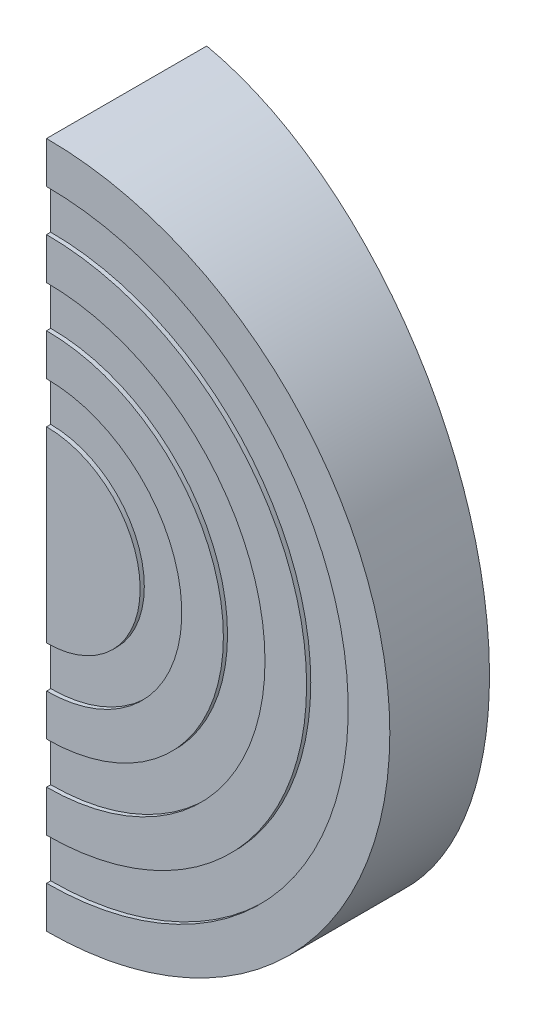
ISO-10303-21;
HEADER;
FILE_DESCRIPTION(('STEP AP214'),'2;1');
FILE_NAME('part.step','',(''),(''),'','','');
FILE_SCHEMA(('AUTOMOTIVE_DESIGN { 1 0 10303 214 1 1 1 1 }'));
ENDSEC;
DATA;
#1=APPLICATION_CONTEXT('core data for automotive mechanical design processes');
#2=APPLICATION_PROTOCOL_DEFINITION('international standard','automotive_design',2000,#1);
#3=PRODUCT_CONTEXT('',#1,'mechanical');
#4=PRODUCT('Part','Part','',(#3));
#5=PRODUCT_RELATED_PRODUCT_CATEGORY('part','',(#4));
#6=PRODUCT_DEFINITION_FORMATION('','',#4);
#7=PRODUCT_DEFINITION_CONTEXT('part definition',#1,'design');
#8=PRODUCT_DEFINITION('design','',#6,#7);
#9=PRODUCT_DEFINITION_SHAPE('','',#8);
#10=(LENGTH_UNIT() NAMED_UNIT(*) SI_UNIT(.MILLI.,.METRE.));
#11=(NAMED_UNIT(*) PLANE_ANGLE_UNIT() SI_UNIT($,.RADIAN.));
#12=(NAMED_UNIT(*) SI_UNIT($,.STERADIAN.) SOLID_ANGLE_UNIT());
#13=UNCERTAINTY_MEASURE_WITH_UNIT(LENGTH_MEASURE(1.E-05),#10,'distance_accuracy_value','');
#14=(GEOMETRIC_REPRESENTATION_CONTEXT(3) GLOBAL_UNCERTAINTY_ASSIGNED_CONTEXT((#13)) GLOBAL_UNIT_ASSIGNED_CONTEXT((#10,
#11,#12)) REPRESENTATION_CONTEXT('',''));
#15=CARTESIAN_POINT('',(0.,0.,0.));
#16=DIRECTION('',(0.,0.,1.));
#17=DIRECTION('',(1.,0.,0.));
#18=AXIS2_PLACEMENT_3D('',#15,#16,#17);
#19=CARTESIAN_POINT('',(5.59106006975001,0.,1.29756118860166));
#20=DIRECTION('',(-0.173648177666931,0.,0.984807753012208));
#21=DIRECTION('',(0.984807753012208,0.,0.173648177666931));
#22=AXIS2_PLACEMENT_3D('',#19,#20,#21);
#23=PLANE('',#22);
#24=CARTESIAN_POINT('',(1.27502279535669,14.3661645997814,0.536527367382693));
#25=CARTESIAN_POINT('',(1.48020566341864,14.3381441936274,0.57270664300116));
#26=CARTESIAN_POINT('',(1.68478495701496,14.3057523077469,0.60877949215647));
#27=CARTESIAN_POINT('',(2.0924217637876,14.2322651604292,0.68065685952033));
#28=CARTESIAN_POINT('',(2.29547927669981,14.1911698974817,0.716461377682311));
#29=CARTESIAN_POINT('',(2.90181089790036,14.0549078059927,0.823374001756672));
#30=CARTESIAN_POINT('',(3.30233184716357,13.9467526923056,0.893996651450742));
#31=CARTESIAN_POINT('',(4.09289086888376,13.6965843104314,1.0333935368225));
#32=CARTESIAN_POINT('',(4.482929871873,13.5545740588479,1.10216793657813));
#33=CARTESIAN_POINT('',(5.24978501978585,13.2375567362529,1.23738518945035));
#34=CARTESIAN_POINT('',(5.62660150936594,13.0625505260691,1.30382810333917));
#35=CARTESIAN_POINT('',(6.3641335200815,12.6808131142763,1.43387489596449));
#36=CARTESIAN_POINT('',(6.72485506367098,12.4740939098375,1.49747983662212));
#37=CARTESIAN_POINT('',(7.42765723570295,12.0302025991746,1.62140282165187));
#38=CARTESIAN_POINT('',(7.76973759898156,11.7930300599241,1.68172081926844));
#39=CARTESIAN_POINT('',(8.43257498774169,11.2899812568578,1.7985969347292));
#40=CARTESIAN_POINT('',(8.75334021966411,11.0241161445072,1.85515649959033));
#41=CARTESIAN_POINT('',(9.37120561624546,10.4654024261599,1.96410283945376));
#42=CARTESIAN_POINT('',(9.66830618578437,10.1725542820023,2.01648968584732));
#43=CARTESIAN_POINT('',(10.2327229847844,9.5660768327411,2.11601159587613));
#44=CARTESIAN_POINT('',(10.5003869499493,9.25278117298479,2.16320797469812));
#45=CARTESIAN_POINT('',(11.0083795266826,8.6041116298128,2.25278077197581));
#46=CARTESIAN_POINT('',(11.2487082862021,8.26873786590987,2.2951572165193));
#47=CARTESIAN_POINT('',(11.7001826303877,7.57825996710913,2.37476432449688));
#48=CARTESIAN_POINT('',(11.911325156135,7.22315376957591,2.41199444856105));
#49=CARTESIAN_POINT('',(12.3027103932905,6.49579590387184,2.48100622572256));
#50=CARTESIAN_POINT('',(12.4829534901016,6.12354444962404,2.51278794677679));
#51=CARTESIAN_POINT('',(12.8082692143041,5.37111156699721,2.57014988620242));
#52=CARTESIAN_POINT('',(12.9538908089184,4.99117477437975,2.5958269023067));
#53=CARTESIAN_POINT('',(13.2127389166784,4.22008759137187,2.64146880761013));
#54=CARTESIAN_POINT('',(13.3259657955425,3.82893732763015,2.66143376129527));
#55=CARTESIAN_POINT('',(13.51907739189,3.03829434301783,2.69548454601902));
#56=CARTESIAN_POINT('',(13.5989664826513,2.63880272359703,2.70957114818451));
#57=CARTESIAN_POINT('',(13.7248235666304,1.83434685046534,2.7317631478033));
#58=CARTESIAN_POINT('',(13.7707917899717,1.42938263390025,2.73986858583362));
#59=CARTESIAN_POINT('',(13.8280105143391,0.622209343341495,2.7499577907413));
#60=CARTESIAN_POINT('',(13.839702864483,0.220032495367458,2.75201946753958));
#61=CARTESIAN_POINT('',(13.8295931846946,-0.58403829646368,2.75023685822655));
#62=CARTESIAN_POINT('',(13.8077786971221,-0.985932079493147,2.7463903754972));
#63=CARTESIAN_POINT('',(13.730755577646,-1.78622985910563,2.73280912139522));
#64=CARTESIAN_POINT('',(13.6755613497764,-2.18463528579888,2.72307688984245));
#65=CARTESIAN_POINT('',(13.5322605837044,-2.97548135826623,2.69780909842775));
#66=CARTESIAN_POINT('',(13.4441391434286,-3.36791921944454,2.68227091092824));
#67=CARTESIAN_POINT('',(13.2359121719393,-4.14272185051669,2.64555487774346));
#68=CARTESIAN_POINT('',(13.1158999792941,-4.52511249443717,2.62439349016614));
#69=CARTESIAN_POINT('',(12.8448256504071,-5.27817551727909,2.57659577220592));
#70=CARTESIAN_POINT('',(12.6937774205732,-5.64885305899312,2.54996189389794));
#71=CARTESIAN_POINT('',(12.3616292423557,-6.37623471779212,2.49139520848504));
#72=CARTESIAN_POINT('',(12.1805171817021,-6.73293313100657,2.45946026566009));
#73=CARTESIAN_POINT('',(11.7897643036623,-7.42966260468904,2.3905599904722));
#74=CARTESIAN_POINT('',(11.5801336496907,-7.76969954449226,2.35359645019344));
#75=CARTESIAN_POINT('',(11.1319651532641,-8.43369232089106,2.27457225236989));
#76=CARTESIAN_POINT('',(10.8932016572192,-8.75749111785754,2.23247180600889));
#77=CARTESIAN_POINT('',(10.3899626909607,-9.38378325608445,2.14373719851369));
#78=CARTESIAN_POINT('',(10.1254870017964,-9.68627641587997,2.09710299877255));
#79=CARTESIAN_POINT('',(9.57270244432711,-10.2680183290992,1.99963216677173));
#80=CARTESIAN_POINT('',(9.28438891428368,-10.5472625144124,1.94879471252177));
#81=CARTESIAN_POINT('',(8.68604452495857,-11.0806138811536,1.84329045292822));
#82=CARTESIAN_POINT('',(8.37601387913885,-11.3347213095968,1.78862368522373));
#83=CARTESIAN_POINT('',(7.73138127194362,-11.820022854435,1.67495756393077));
#84=CARTESIAN_POINT('',(7.39646825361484,-12.0507910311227,1.6159033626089));
#85=CARTESIAN_POINT('',(6.70886433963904,-12.4832403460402,1.49466024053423));
#86=CARTESIAN_POINT('',(6.35617179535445,-12.6849187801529,1.43247102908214));
#87=CARTESIAN_POINT('',(5.63577762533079,-13.0578162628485,1.30544610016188));
#88=CARTESIAN_POINT('',(5.26808554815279,-13.2290543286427,1.24061206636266));
#89=CARTESIAN_POINT('',(4.52016975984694,-13.5400495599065,1.1087343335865));
#90=CARTESIAN_POINT('',(4.13995009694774,-13.6798167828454,1.04169134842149));
#91=CARTESIAN_POINT('',(3.350002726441,-13.9333705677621,0.902402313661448));
#92=CARTESIAN_POINT('',(2.93975337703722,-14.045493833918,0.830064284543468));
#93=CARTESIAN_POINT('',(2.3188971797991,-14.1863073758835,0.72059058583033));
#94=CARTESIAN_POINT('',(2.11120834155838,-14.2286591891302,0.683969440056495));
#95=CARTESIAN_POINT('',(1.69423169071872,-14.3042537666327,0.610445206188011));
#96=CARTESIAN_POINT('',(1.48494389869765,-14.3374966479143,0.573542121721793));
#97=CARTESIAN_POINT('',(1.27502279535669,-14.3661645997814,0.536527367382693));
#98=B_SPLINE_CURVE_WITH_KNOTS('',3,(#24,#25,#26,#27,#28,#29,#30,#31,#32,#33,#34,#35,#36,#37,#38,
#39,#40,#41,#42,#43,#44,#45,#46,#47,#48,#49,#50,#51,#52,#53,#54,#55,#56,#57,#58,#59,#60,#61,#62,
#63,#64,#65,#66,#67,#68,#69,#70,#71,#72,#73,#74,#75,#76,#77,#78,#79,#80,#81,#82,#83,#84,#85,#86,
#87,#88,#89,#90,#91,#92,#93,#94,#95,#96,#97),.UNSPECIFIED.,.F.,.F.,(4,2,2,2,2,2,2,2,2,2,2,2,2,2,
2,2,2,2,2,2,2,2,2,2,2,2,2,2,2,2,2,2,2,2,2,2,4),(0.,0.630575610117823,1.26115132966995,
2.52203389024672,3.78280414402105,5.04354151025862,6.30380310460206,7.56408262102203,
8.82387407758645,10.0836439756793,11.3264189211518,12.5691871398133,13.8120855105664,
15.0549683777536,16.2765869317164,17.4981916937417,18.719636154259,19.9410723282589,
21.1466922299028,22.3527604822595,23.5583086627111,24.7644031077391,25.9670056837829,
27.1690705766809,28.371620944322,29.5737438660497,30.7858522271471,31.9979709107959,
33.210327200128,34.4226715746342,35.6541895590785,36.8858219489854,38.1166821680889,
39.3471484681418,40.6395946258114,41.2847337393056,41.9298645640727),.UNSPECIFIED.);
#99=CARTESIAN_POINT('',(1.27502279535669,14.3661645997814,0.536527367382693));
#100=VERTEX_POINT('',#99);
#101=CARTESIAN_POINT('',(1.27502279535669,-14.3661645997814,0.536527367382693));
#102=VERTEX_POINT('',#101);
#103=EDGE_CURVE('E22',#100,#102,#98,.T.);
#104=ORIENTED_EDGE('',*,*,#103,.T.);
#105=DIRECTION('',(0.,1.,0.));
#106=VECTOR('',#105,1.);
#107=CARTESIAN_POINT('',(1.27502279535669,-14.3661645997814,0.536527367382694));
#108=LINE('',#107,#106);
#109=EDGE_CURVE('E136',#102,#100,#108,.T.);
#110=ORIENTED_EDGE('',*,*,#109,.T.);
#111=EDGE_LOOP('',(#104,#110));
#112=FACE_BOUND('',#111,.T.);
#113=ADVANCED_FACE('F15',(#112),#23,.F.);
#114=CARTESIAN_POINT('',(0.,0.,3.75));
#115=DIRECTION('',(0.,0.,1.));
#116=DIRECTION('',(1.,0.,0.));
#117=AXIS2_PLACEMENT_3D('',#114,#115,#116);
#118=CYLINDRICAL_SURFACE('',#117,4.5);
#119=CARTESIAN_POINT('',(0.,0.,3.75));
#120=DIRECTION('',(0.,0.,1.));
#121=DIRECTION('',(1.,0.,0.));
#122=AXIS2_PLACEMENT_3D('',#119,#120,#121);
#123=CIRCLE('',#122,4.5);
#124=CARTESIAN_POINT('',(0.,4.5,3.75));
#125=VERTEX_POINT('',#124);
#126=CARTESIAN_POINT('',(0.,-4.5,3.75));
#127=VERTEX_POINT('',#126);
#128=EDGE_CURVE('E312',#125,#127,#123,.F.);
#129=ORIENTED_EDGE('',*,*,#128,.F.);
#130=DIRECTION('',(0.,0.,1.));
#131=VECTOR('',#130,1.);
#132=CARTESIAN_POINT('',(0.,4.5,3.75));
#133=LINE('',#132,#131);
#134=CARTESIAN_POINT('',(0.,4.5,3.95));
#135=VERTEX_POINT('',#134);
#136=EDGE_CURVE('E155',#125,#135,#133,.T.);
#137=ORIENTED_EDGE('',*,*,#136,.T.);
#138=CARTESIAN_POINT('',(0.,0.,3.95));
#139=DIRECTION('',(0.,0.,1.));
#140=DIRECTION('',(1.,0.,0.));
#141=AXIS2_PLACEMENT_3D('',#138,#139,#140);
#142=CIRCLE('',#141,4.5);
#143=CARTESIAN_POINT('',(0.,-4.5,3.95));
#144=VERTEX_POINT('',#143);
#145=EDGE_CURVE('E289',#144,#135,#142,.T.);
#146=ORIENTED_EDGE('',*,*,#145,.F.);
#147=DIRECTION('',(0.,0.,1.));
#148=VECTOR('',#147,1.);
#149=CARTESIAN_POINT('',(0.,-4.5,3.75));
#150=LINE('',#149,#148);
#151=EDGE_CURVE('E306',#144,#127,#150,.F.);
#152=ORIENTED_EDGE('',*,*,#151,.T.);
#153=EDGE_LOOP('',(#129,#137,#146,#152));
#154=FACE_BOUND('',#153,.T.);
#155=ADVANCED_FACE('F227',(#154),#118,.T.);
#156=CARTESIAN_POINT('',(0.,0.,3.75));
#157=DIRECTION('',(0.,0.,1.));
#158=DIRECTION('',(1.,0.,0.));
#159=AXIS2_PLACEMENT_3D('',#156,#157,#158);
#160=CYLINDRICAL_SURFACE('',#159,6.5);
#161=DIRECTION('',(0.,0.,1.));
#162=VECTOR('',#161,1.);
#163=CARTESIAN_POINT('',(0.,6.5,3.75));
#164=LINE('',#163,#162);
#165=CARTESIAN_POINT('',(0.,6.5,3.75));
#166=VERTEX_POINT('',#165);
#167=CARTESIAN_POINT('',(0.,6.5,3.95));
#168=VERTEX_POINT('',#167);
#169=EDGE_CURVE('E302',#166,#168,#164,.T.);
#170=ORIENTED_EDGE('',*,*,#169,.F.);
#171=CARTESIAN_POINT('',(0.,0.,3.75));
#172=DIRECTION('',(0.,0.,1.));
#173=DIRECTION('',(1.,0.,0.));
#174=AXIS2_PLACEMENT_3D('',#171,#172,#173);
#175=CIRCLE('',#174,6.5);
#176=CARTESIAN_POINT('',(0.,-6.5,3.75));
#177=VERTEX_POINT('',#176);
#178=EDGE_CURVE('E314',#177,#166,#175,.T.);
#179=ORIENTED_EDGE('',*,*,#178,.F.);
#180=DIRECTION('',(0.,0.,1.));
#181=VECTOR('',#180,1.);
#182=CARTESIAN_POINT('',(0.,-6.5,3.75));
#183=LINE('',#182,#181);
#184=CARTESIAN_POINT('',(0.,-6.5,3.95));
#185=VERTEX_POINT('',#184);
#186=EDGE_CURVE('E305',#185,#177,#183,.F.);
#187=ORIENTED_EDGE('',*,*,#186,.F.);
#188=CARTESIAN_POINT('',(0.,0.,3.95));
#189=DIRECTION('',(0.,0.,1.));
#190=DIRECTION('',(1.,0.,0.));
#191=AXIS2_PLACEMENT_3D('',#188,#189,#190);
#192=CIRCLE('',#191,6.5);
#193=EDGE_CURVE('E321',#168,#185,#192,.F.);
#194=ORIENTED_EDGE('',*,*,#193,.F.);
#195=EDGE_LOOP('',(#170,#179,#187,#194));
#196=FACE_BOUND('',#195,.T.);
#197=ADVANCED_FACE('F223',(#196),#160,.F.);
#198=CARTESIAN_POINT('',(0.,0.,3.75));
#199=DIRECTION('',(0.,0.,1.));
#200=DIRECTION('',(1.,0.,0.));
#201=AXIS2_PLACEMENT_3D('',#198,#199,#200);
#202=CYLINDRICAL_SURFACE('',#201,8.5);
#203=CARTESIAN_POINT('',(0.,0.,3.75));
#204=DIRECTION('',(0.,0.,1.));
#205=DIRECTION('',(1.,0.,0.));
#206=AXIS2_PLACEMENT_3D('',#203,#204,#205);
#207=CIRCLE('',#206,8.5);
#208=CARTESIAN_POINT('',(0.,8.5,3.75));
#209=VERTEX_POINT('',#208);
#210=CARTESIAN_POINT('',(0.,-8.5,3.75));
#211=VERTEX_POINT('',#210);
#212=EDGE_CURVE('E330',#209,#211,#207,.F.);
#213=ORIENTED_EDGE('',*,*,#212,.F.);
#214=DIRECTION('',(0.,0.,1.));
#215=VECTOR('',#214,1.);
#216=CARTESIAN_POINT('',(0.,8.5,3.75));
#217=LINE('',#216,#215);
#218=CARTESIAN_POINT('',(0.,8.5,3.95));
#219=VERTEX_POINT('',#218);
#220=EDGE_CURVE('E299',#209,#219,#217,.T.);
#221=ORIENTED_EDGE('',*,*,#220,.T.);
#222=CARTESIAN_POINT('',(0.,0.,3.95));
#223=DIRECTION('',(0.,0.,1.));
#224=DIRECTION('',(1.,0.,0.));
#225=AXIS2_PLACEMENT_3D('',#222,#223,#224);
#226=CIRCLE('',#225,8.5);
#227=CARTESIAN_POINT('',(0.,-8.5,3.95));
#228=VERTEX_POINT('',#227);
#229=EDGE_CURVE('E318',#228,#219,#226,.T.);
#230=ORIENTED_EDGE('',*,*,#229,.F.);
#231=DIRECTION('',(0.,0.,1.));
#232=VECTOR('',#231,1.);
#233=CARTESIAN_POINT('',(0.,-8.5,3.75));
#234=LINE('',#233,#232);
#235=EDGE_CURVE('E300',#228,#211,#234,.F.);
#236=ORIENTED_EDGE('',*,*,#235,.T.);
#237=EDGE_LOOP('',(#213,#221,#230,#236));
#238=FACE_BOUND('',#237,.T.);
#239=ADVANCED_FACE('F219',(#238),#202,.T.);
#240=CARTESIAN_POINT('',(0.,0.,3.75));
#241=DIRECTION('',(0.,0.,1.));
#242=DIRECTION('',(1.,0.,0.));
#243=AXIS2_PLACEMENT_3D('',#240,#241,#242);
#244=CYLINDRICAL_SURFACE('',#243,10.5);
#245=DIRECTION('',(0.,0.,1.));
#246=VECTOR('',#245,1.);
#247=CARTESIAN_POINT('',(0.,10.5,3.75));
#248=LINE('',#247,#246);
#249=CARTESIAN_POINT('',(0.,10.5,3.75));
#250=VERTEX_POINT('',#249);
#251=CARTESIAN_POINT('',(0.,10.5,3.95));
#252=VERTEX_POINT('',#251);
#253=EDGE_CURVE('E294',#250,#252,#248,.T.);
#254=ORIENTED_EDGE('',*,*,#253,.F.);
#255=CARTESIAN_POINT('',(0.,0.,3.75));
#256=DIRECTION('',(0.,0.,1.));
#257=DIRECTION('',(1.,0.,0.));
#258=AXIS2_PLACEMENT_3D('',#255,#256,#257);
#259=CIRCLE('',#258,10.5);
#260=CARTESIAN_POINT('',(0.,-10.5,3.75));
#261=VERTEX_POINT('',#260);
#262=EDGE_CURVE('E327',#261,#250,#259,.T.);
#263=ORIENTED_EDGE('',*,*,#262,.F.);
#264=DIRECTION('',(0.,0.,1.));
#265=VECTOR('',#264,1.);
#266=CARTESIAN_POINT('',(0.,-10.5,3.75));
#267=LINE('',#266,#265);
#268=CARTESIAN_POINT('',(0.,-10.5,3.95));
#269=VERTEX_POINT('',#268);
#270=EDGE_CURVE('E297',#269,#261,#267,.F.);
#271=ORIENTED_EDGE('',*,*,#270,.F.);
#272=CARTESIAN_POINT('',(0.,0.,3.95));
#273=DIRECTION('',(0.,0.,1.));
#274=DIRECTION('',(1.,0.,0.));
#275=AXIS2_PLACEMENT_3D('',#272,#273,#274);
#276=CIRCLE('',#275,10.5);
#277=EDGE_CURVE('E336',#252,#269,#276,.F.);
#278=ORIENTED_EDGE('',*,*,#277,.F.);
#279=EDGE_LOOP('',(#254,#263,#271,#278));
#280=FACE_BOUND('',#279,.T.);
#281=ADVANCED_FACE('F215',(#280),#244,.F.);
#282=CARTESIAN_POINT('',(0.,0.,3.75));
#283=DIRECTION('',(0.,0.,1.));
#284=DIRECTION('',(1.,0.,0.));
#285=AXIS2_PLACEMENT_3D('',#282,#283,#284);
#286=CYLINDRICAL_SURFACE('',#285,12.5);
#287=CARTESIAN_POINT('',(0.,0.,3.75));
#288=DIRECTION('',(0.,0.,1.));
#289=DIRECTION('',(1.,0.,0.));
#290=AXIS2_PLACEMENT_3D('',#287,#288,#289);
#291=CIRCLE('',#290,12.5);
#292=CARTESIAN_POINT('',(0.,12.5,3.75));
#293=VERTEX_POINT('',#292);
#294=CARTESIAN_POINT('',(0.,-12.5,3.75));
#295=VERTEX_POINT('',#294);
#296=EDGE_CURVE('E172',#293,#295,#291,.F.);
#297=ORIENTED_EDGE('',*,*,#296,.F.);
#298=DIRECTION('',(0.,0.,1.));
#299=VECTOR('',#298,1.);
#300=CARTESIAN_POINT('',(0.,12.5,3.75));
#301=LINE('',#300,#299);
#302=CARTESIAN_POINT('',(0.,12.5,3.95));
#303=VERTEX_POINT('',#302);
#304=EDGE_CURVE('E139',#293,#303,#301,.T.);
#305=ORIENTED_EDGE('',*,*,#304,.T.);
#306=CARTESIAN_POINT('',(0.,0.,3.95));
#307=DIRECTION('',(0.,0.,1.));
#308=DIRECTION('',(1.,0.,0.));
#309=AXIS2_PLACEMENT_3D('',#306,#307,#308);
#310=CIRCLE('',#309,12.5);
#311=CARTESIAN_POINT('',(0.,-12.5,3.95));
#312=VERTEX_POINT('',#311);
#313=EDGE_CURVE('E333',#312,#303,#310,.T.);
#314=ORIENTED_EDGE('',*,*,#313,.F.);
#315=DIRECTION('',(0.,0.,1.));
#316=VECTOR('',#315,1.);
#317=CARTESIAN_POINT('',(0.,-12.5,3.75));
#318=LINE('',#317,#316);
#319=EDGE_CURVE('E292',#312,#295,#318,.F.);
#320=ORIENTED_EDGE('',*,*,#319,.T.);
#321=EDGE_LOOP('',(#297,#305,#314,#320));
#322=FACE_BOUND('',#321,.T.);
#323=ADVANCED_FACE('F212',(#322),#286,.T.);
#324=CARTESIAN_POINT('',(1.96961550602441,-14.3661645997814,-3.40270364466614));
#325=CARTESIAN_POINT('',(1.27502279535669,-14.3661645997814,0.536527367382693));
#326=CARTESIAN_POINT('',(2.5446479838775,-14.2876537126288,-3.301309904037));
#327=CARTESIAN_POINT('',(1.85005527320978,-14.2876537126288,0.637921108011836));
#328=CARTESIAN_POINT('',(3.68520447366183,-14.0618070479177,-3.10019902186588));
#329=CARTESIAN_POINT('',(2.9906117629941,-14.0618070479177,0.839031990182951));
#330=CARTESIAN_POINT('',(5.0665251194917,-13.6115458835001,-2.85663492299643));
#331=CARTESIAN_POINT('',(4.37193240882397,-13.6115458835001,1.0825960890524));
#332=CARTESIAN_POINT('',(6.39969436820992,-13.040369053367,-2.62156121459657));
#333=CARTESIAN_POINT('',(5.7051016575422,-13.040369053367,1.31766979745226));
#334=CARTESIAN_POINT('',(7.4219355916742,-12.4892098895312,-2.44131250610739));
#335=CARTESIAN_POINT('',(6.72734288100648,-12.4892098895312,1.49791850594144));
#336=CARTESIAN_POINT('',(8.63068698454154,-11.6900525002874,-2.22817702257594));
#337=CARTESIAN_POINT('',(7.93609427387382,-11.6900525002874,1.71105398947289));
#338=CARTESIAN_POINT('',(9.53725423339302,-10.9660796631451,-2.06832475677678));
#339=CARTESIAN_POINT('',(8.84266152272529,-10.9660796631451,1.87090625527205));
#340=CARTESIAN_POINT('',(10.582881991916,-9.96515740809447,-1.88395237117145));
#341=CARTESIAN_POINT('',(9.88828928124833,-9.96515740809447,2.05527864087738));
#342=CARTESIAN_POINT('',(11.3448669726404,-9.09202815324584,-1.74959386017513));
#343=CARTESIAN_POINT('',(10.6502742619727,-9.09202815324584,2.1896371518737));
#344=CARTESIAN_POINT('',(12.194173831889,-7.92190845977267,-1.59983814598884));
#345=CARTESIAN_POINT('',(11.4995811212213,-7.92190845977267,2.33939286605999));
#346=CARTESIAN_POINT('',(12.7874984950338,-6.92791317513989,-1.49521899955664));
#347=CARTESIAN_POINT('',(12.0929057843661,-6.92791317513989,2.44401201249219));
#348=CARTESIAN_POINT('',(13.4137654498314,-5.62634328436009,-1.3847912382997));
#349=CARTESIAN_POINT('',(12.7191727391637,-5.62634328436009,2.55443977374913));
#350=CARTESIAN_POINT('',(13.8198509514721,-4.54341546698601,-1.31318740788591));
#351=CARTESIAN_POINT('',(13.1252582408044,-4.54341546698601,2.62604360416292));
#352=CARTESIAN_POINT('',(14.2035428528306,-3.15204893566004,-1.24553217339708));
#353=CARTESIAN_POINT('',(13.5089501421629,-3.15204893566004,2.69369883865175));
#354=CARTESIAN_POINT('',(14.4097723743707,-2.0147253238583,-1.20916834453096));
#355=CARTESIAN_POINT('',(13.715179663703,-2.0147253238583,2.73006266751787));
#356=CARTESIAN_POINT('',(14.5389996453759,-0.577813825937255,-1.18638209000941));
#357=CARTESIAN_POINT('',(13.8444069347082,-0.577813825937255,2.75284892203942));
#358=CARTESIAN_POINT('',(14.5389996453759,0.577813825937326,-1.18638209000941));
#359=CARTESIAN_POINT('',(13.8444069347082,0.577813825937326,2.75284892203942));
#360=CARTESIAN_POINT('',(14.4097723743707,2.01472532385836,-1.20916834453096));
#361=CARTESIAN_POINT('',(13.715179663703,2.01472532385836,2.73006266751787));
#362=CARTESIAN_POINT('',(14.2035428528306,3.1520489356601,-1.24553217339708));
#363=CARTESIAN_POINT('',(13.5089501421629,3.1520489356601,2.69369883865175));
#364=CARTESIAN_POINT('',(13.8198509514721,4.54341546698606,-1.31318740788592));
#365=CARTESIAN_POINT('',(13.1252582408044,4.54341546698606,2.62604360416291));
#366=CARTESIAN_POINT('',(13.4137654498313,5.62634328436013,-1.38479123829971));
#367=CARTESIAN_POINT('',(12.7191727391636,5.62634328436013,2.55443977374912));
#368=CARTESIAN_POINT('',(12.7874984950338,6.92791317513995,-1.49521899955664));
#369=CARTESIAN_POINT('',(12.0929057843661,6.92791317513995,2.44401201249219));
#370=CARTESIAN_POINT('',(12.194173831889,7.92190845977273,-1.59983814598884));
#371=CARTESIAN_POINT('',(11.4995811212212,7.92190845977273,2.33939286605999));
#372=CARTESIAN_POINT('',(11.3448669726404,9.09202815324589,-1.74959386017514));
#373=CARTESIAN_POINT('',(10.6502742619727,9.09202815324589,2.1896371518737));
#374=CARTESIAN_POINT('',(10.582881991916,9.96515740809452,-1.88395237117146));
#375=CARTESIAN_POINT('',(9.88828928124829,9.96515740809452,2.05527864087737));
#376=CARTESIAN_POINT('',(9.53725423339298,10.9660796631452,-2.06832475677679));
#377=CARTESIAN_POINT('',(8.84266152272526,10.9660796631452,1.87090625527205));
#378=CARTESIAN_POINT('',(8.6306869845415,11.6900525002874,-2.22817702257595));
#379=CARTESIAN_POINT('',(7.93609427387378,11.6900525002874,1.71105398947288));
#380=CARTESIAN_POINT('',(7.42193559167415,12.4892098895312,-2.4413125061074));
#381=CARTESIAN_POINT('',(6.72734288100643,12.4892098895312,1.49791850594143));
#382=CARTESIAN_POINT('',(6.39969436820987,13.040369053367,-2.62156121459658));
#383=CARTESIAN_POINT('',(5.70510165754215,13.040369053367,1.31766979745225));
#384=CARTESIAN_POINT('',(5.06652511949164,13.6115458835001,-2.85663492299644));
#385=CARTESIAN_POINT('',(4.37193240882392,13.6115458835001,1.08259608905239));
#386=CARTESIAN_POINT('',(3.68520447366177,14.0618070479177,-3.10019902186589));
#387=CARTESIAN_POINT('',(2.99061176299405,14.0618070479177,0.839031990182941));
#388=CARTESIAN_POINT('',(2.54464798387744,14.2876537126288,-3.30130990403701));
#389=CARTESIAN_POINT('',(1.85005527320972,14.2876537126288,0.637921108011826));
#390=CARTESIAN_POINT('',(1.96961550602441,14.3661645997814,-3.40270364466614));
#391=CARTESIAN_POINT('',(1.27502279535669,14.3661645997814,0.536527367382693));
#392=B_SPLINE_SURFACE_WITH_KNOTS('',3,1,((#324,#325),(#326,#327),(#328,#329),(#330,#331),(#332,
#333),(#334,#335),(#336,#337),(#338,#339),(#340,#341),(#342,#343),(#344,#345),(#346,#347),(#348,
#349),(#350,#351),(#352,#353),(#354,#355),(#356,#357),(#358,#359),(#360,#361),(#362,#363),(#364,
#365),(#366,#367),(#368,#369),(#370,#371),(#372,#373),(#374,#375),(#376,#377),(#378,#379),(#380,
#381),(#382,#383),(#384,#385),(#386,#387),(#388,#389),(#390,#391)),.UNSPECIFIED.,.F.,.F.,.F.,(4,
1,1,1,1,1,1,1,1,1,1,1,1,1,1,1,1,1,1,1,1,1,1,1,1,1,1,1,1,1,1,4),(2,2),(1.70649027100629,
1.82608213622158,1.94567400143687,2.00546993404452,2.12506179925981,2.18485773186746,
2.30444959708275,2.36424552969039,2.48383739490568,2.54363332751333,2.66322519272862,
2.72302112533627,2.84261299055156,2.90240892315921,3.0220007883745,3.08179672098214,
3.20138858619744,3.26118451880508,3.38077638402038,3.44057231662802,3.56016418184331,
3.61996011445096,3.73955197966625,3.7993479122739,3.91893977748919,3.97873571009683,
4.09832757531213,4.15812350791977,4.27771537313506,4.33751130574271,4.457103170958,
4.57669503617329),(0.,0.4),.UNSPECIFIED.);
#393=DIRECTION('',(-0.173648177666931,0.,0.984807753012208));
#394=VECTOR('',#393,1.);
#395=CARTESIAN_POINT('',(1.96961550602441,14.3661645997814,-3.40270364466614));
#396=LINE('',#395,#394);
#397=CARTESIAN_POINT('',(1.96961550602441,14.3661645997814,-3.40270364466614));
#398=VERTEX_POINT('',#397);
#399=EDGE_CURVE('E138',#100,#398,#396,.F.);
#400=CARTESIAN_POINT('',(1.96961550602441,14.3661645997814,-3.40270364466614));
#401=CARTESIAN_POINT('',(2.17479837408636,14.3381441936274,-3.36652436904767));
#402=CARTESIAN_POINT('',(2.37937766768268,14.3057523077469,-3.33045151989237));
#403=CARTESIAN_POINT('',(2.78701447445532,14.2322651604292,-3.25857415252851));
#404=CARTESIAN_POINT('',(2.99007198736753,14.1911698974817,-3.22276963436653));
#405=CARTESIAN_POINT('',(3.59640360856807,14.0549078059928,-3.11585701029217));
#406=CARTESIAN_POINT('',(3.99692455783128,13.9467526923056,-3.0452343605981));
#407=CARTESIAN_POINT('',(4.78748357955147,13.6965843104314,-2.90583747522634));
#408=CARTESIAN_POINT('',(5.1775225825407,13.5545740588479,-2.8370630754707));
#409=CARTESIAN_POINT('',(5.94437773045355,13.2375567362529,-2.70184582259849));
#410=CARTESIAN_POINT('',(6.32119422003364,13.0625505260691,-2.63540290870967));
#411=CARTESIAN_POINT('',(7.05872623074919,12.6808131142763,-2.50535611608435));
#412=CARTESIAN_POINT('',(7.41944777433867,12.4740939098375,-2.44175117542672));
#413=CARTESIAN_POINT('',(8.12224994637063,12.0302025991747,-2.31782819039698));
#414=CARTESIAN_POINT('',(8.46433030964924,11.7930300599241,-2.2575101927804));
#415=CARTESIAN_POINT('',(9.12716769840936,11.2899812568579,-2.14063407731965));
#416=CARTESIAN_POINT('',(9.44793293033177,11.0241161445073,-2.08407451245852));
#417=CARTESIAN_POINT('',(10.0657983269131,10.46540242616,-1.97512817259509));
#418=CARTESIAN_POINT('',(10.362898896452,10.1725542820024,-1.92274132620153));
#419=CARTESIAN_POINT('',(10.9273156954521,9.56607683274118,-1.82321941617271));
#420=CARTESIAN_POINT('',(11.194979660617,9.25278117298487,-1.77602303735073));
#421=CARTESIAN_POINT('',(11.7029722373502,8.60411162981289,-1.68645024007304));
#422=CARTESIAN_POINT('',(11.9433009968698,8.26873786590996,-1.64407379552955));
#423=CARTESIAN_POINT('',(12.3947753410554,7.57825996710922,-1.56446668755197));
#424=CARTESIAN_POINT('',(12.6059178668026,7.22315376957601,-1.5272365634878));
#425=CARTESIAN_POINT('',(12.9973031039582,6.49579590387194,-1.45822478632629));
#426=CARTESIAN_POINT('',(13.1775462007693,6.12354444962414,-1.42644306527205));
#427=CARTESIAN_POINT('',(13.5028619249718,5.37111156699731,-1.36908112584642));
#428=CARTESIAN_POINT('',(13.6484835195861,4.99117477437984,-1.34340410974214));
#429=CARTESIAN_POINT('',(13.9073316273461,4.22008759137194,-1.29776220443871));
#430=CARTESIAN_POINT('',(14.0205585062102,3.82893732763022,-1.27779725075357));
#431=CARTESIAN_POINT('',(14.2136701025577,3.03829434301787,-1.24374646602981));
#432=CARTESIAN_POINT('',(14.293559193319,2.63880272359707,-1.22965986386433));
#433=CARTESIAN_POINT('',(14.4194162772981,1.83434685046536,-1.20746786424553));
#434=CARTESIAN_POINT('',(14.4653845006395,1.42938263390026,-1.19936242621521));
#435=CARTESIAN_POINT('',(14.5226032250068,0.622209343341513,-1.18927322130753));
#436=CARTESIAN_POINT('',(14.5342955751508,0.220032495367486,-1.18721154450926));
#437=CARTESIAN_POINT('',(14.5241858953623,-0.58403829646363,-1.18899415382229));
#438=CARTESIAN_POINT('',(14.5023714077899,-0.985932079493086,-1.19284063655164));
#439=CARTESIAN_POINT('',(14.4253482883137,-1.78622985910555,-1.20642189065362));
#440=CARTESIAN_POINT('',(14.3701540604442,-2.18463528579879,-1.21615412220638));
#441=CARTESIAN_POINT('',(14.2268532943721,-2.97548135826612,-1.24142191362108));
#442=CARTESIAN_POINT('',(14.1387318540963,-3.36791921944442,-1.25696010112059));
#443=CARTESIAN_POINT('',(13.930504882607,-4.14272185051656,-1.29367613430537));
#444=CARTESIAN_POINT('',(13.8104926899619,-4.52511249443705,-1.31483752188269));
#445=CARTESIAN_POINT('',(13.5394183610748,-5.27817551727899,-1.36263523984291));
#446=CARTESIAN_POINT('',(13.3883701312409,-5.64885305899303,-1.38926911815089));
#447=CARTESIAN_POINT('',(13.0562219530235,-6.37623471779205,-1.44783580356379));
#448=CARTESIAN_POINT('',(12.8751098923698,-6.7329331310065,-1.47977074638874));
#449=CARTESIAN_POINT('',(12.4843570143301,-7.42966260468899,-1.54867102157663));
#450=CARTESIAN_POINT('',(12.2747263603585,-7.76969954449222,-1.58563456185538));
#451=CARTESIAN_POINT('',(11.8265578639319,-8.43369232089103,-1.66465875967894));
#452=CARTESIAN_POINT('',(11.5877943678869,-8.75749111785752,-1.70675920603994));
#453=CARTESIAN_POINT('',(11.0845554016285,-9.38378325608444,-1.79549381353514));
#454=CARTESIAN_POINT('',(10.8200797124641,-9.68627641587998,-1.84212801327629));
#455=CARTESIAN_POINT('',(10.2672951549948,-10.2680183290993,-1.93959884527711));
#456=CARTESIAN_POINT('',(9.97898162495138,-10.5472625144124,-1.99043629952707));
#457=CARTESIAN_POINT('',(9.38063723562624,-11.0806138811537,-2.09594055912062));
#458=CARTESIAN_POINT('',(9.07060658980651,-11.3347213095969,-2.15060732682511));
#459=CARTESIAN_POINT('',(8.42597398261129,-11.820022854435,-2.26427344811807));
#460=CARTESIAN_POINT('',(8.09106096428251,-12.0507910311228,-2.32332764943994));
#461=CARTESIAN_POINT('',(7.40345705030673,-12.4832403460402,-2.44457077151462));
#462=CARTESIAN_POINT('',(7.05076450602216,-12.6849187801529,-2.5067599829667));
#463=CARTESIAN_POINT('',(6.33037033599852,-13.0578162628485,-2.63378491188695));
#464=CARTESIAN_POINT('',(5.96267825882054,-13.2290543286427,-2.69861894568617));
#465=CARTESIAN_POINT('',(5.21476247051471,-13.5400495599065,-2.83049667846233));
#466=CARTESIAN_POINT('',(4.83454280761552,-13.6798167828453,-2.89753966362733));
#467=CARTESIAN_POINT('',(4.04459543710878,-13.9333705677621,-3.03682869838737));
#468=CARTESIAN_POINT('',(3.63434608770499,-14.045493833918,-3.10916672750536));
#469=CARTESIAN_POINT('',(3.01348989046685,-14.1863073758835,-3.2186404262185));
#470=CARTESIAN_POINT('',(2.80580105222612,-14.2286591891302,-3.25526157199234));
#471=CARTESIAN_POINT('',(2.38882440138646,-14.3042537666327,-3.32878580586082));
#472=CARTESIAN_POINT('',(2.17953660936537,-14.3374966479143,-3.36568889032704));
#473=CARTESIAN_POINT('',(1.96961550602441,-14.3661645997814,-3.40270364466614));
#474=B_SPLINE_CURVE_WITH_KNOTS('',3,(#400,#401,#402,#403,#404,#405,#406,#407,#408,#409,#410,
#411,#412,#413,#414,#415,#416,#417,#418,#419,#420,#421,#422,#423,#424,#425,#426,#427,#428,#429,
#430,#431,#432,#433,#434,#435,#436,#437,#438,#439,#440,#441,#442,#443,#444,#445,#446,#447,#448,
#449,#450,#451,#452,#453,#454,#455,#456,#457,#458,#459,#460,#461,#462,#463,#464,#465,#466,#467,
#468,#469,#470,#471,#472,#473),.UNSPECIFIED.,.F.,.F.,(4,2,2,2,2,2,2,2,2,2,2,2,2,2,2,2,2,2,2,2,2,
2,2,2,2,2,2,2,2,2,2,2,2,2,2,2,4),(0.,0.630575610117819,1.26115132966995,2.52203389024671,
3.78280414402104,5.0435415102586,6.30380310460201,7.56408262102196,8.82387407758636,
10.0836439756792,11.3264189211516,12.5691871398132,13.8120855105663,15.0549683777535,
16.2765869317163,17.4981916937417,18.7196361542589,19.9410723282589,21.1466922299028,
22.3527604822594,23.558308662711,24.764403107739,25.9670056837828,27.1690705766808,
28.371620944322,29.5737438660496,30.7858522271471,31.9979709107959,33.210327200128,
34.4226715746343,35.6541895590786,36.8858219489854,38.1166821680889,39.3471484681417,
40.6395946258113,41.2847337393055,41.9298645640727),.UNSPECIFIED.);
#475=CARTESIAN_POINT('',(1.96961550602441,-14.3661645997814,-3.40270364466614));
#476=VERTEX_POINT('',#475);
#477=EDGE_CURVE('E143',#398,#476,#474,.T.);
#478=DIRECTION('',(-0.173648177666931,0.,0.984807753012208));
#479=VECTOR('',#478,1.);
#480=CARTESIAN_POINT('',(1.96961550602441,-14.3661645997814,-3.40270364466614));
#481=LINE('',#480,#479);
#482=EDGE_CURVE('E141',#476,#102,#481,.T.);
#483=ORIENTED_EDGE('',*,*,#399,.T.);
#484=ORIENTED_EDGE('',*,*,#477,.T.);
#485=ORIENTED_EDGE('',*,*,#482,.T.);
#486=ORIENTED_EDGE('',*,*,#103,.F.);
#487=EDGE_LOOP('',(#483,#484,#485,#486));
#488=FACE_BOUND('',#487,.T.);
#489=ADVANCED_FACE('F17',(#488),#392,.F.);
#490=CARTESIAN_POINT('',(1.96961550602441,-14.3661645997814,-3.40270364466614));
#491=DIRECTION('',(-0.984807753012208,0.,-0.173648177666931));
#492=DIRECTION('',(-0.173648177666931,0.,0.984807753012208));
#493=AXIS2_PLACEMENT_3D('',#490,#491,#492);
#494=PLANE('',#493);
#495=ORIENTED_EDGE('',*,*,#482,.F.);
#496=DIRECTION('',(0.,1.,0.));
#497=VECTOR('',#496,1.);
#498=CARTESIAN_POINT('',(1.96961550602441,8.07384592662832,-3.40270364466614));
#499=LINE('',#498,#497);
#500=EDGE_CURVE('E166',#476,#398,#499,.T.);
#501=ORIENTED_EDGE('',*,*,#500,.T.);
#502=ORIENTED_EDGE('',*,*,#399,.F.);
#503=ORIENTED_EDGE('',*,*,#109,.F.);
#504=EDGE_LOOP('',(#495,#501,#502,#503));
#505=FACE_BOUND('',#504,.T.);
#506=ADVANCED_FACE('F148',(#505),#494,.F.);
#507=CARTESIAN_POINT('',(0.,0.,3.75));
#508=DIRECTION('',(0.,0.,1.));
#509=DIRECTION('',(1.,0.,0.));
#510=AXIS2_PLACEMENT_3D('',#507,#508,#509);
#511=CYLINDRICAL_SURFACE('',#510,14.5);
#512=DIRECTION('',(0.,0.,1.));
#513=VECTOR('',#512,1.);
#514=CARTESIAN_POINT('',(0.,14.5,3.75));
#515=LINE('',#514,#513);
#516=CARTESIAN_POINT('',(0.,14.5,3.75));
#517=VERTEX_POINT('',#516);
#518=CARTESIAN_POINT('',(0.,14.5,3.95));
#519=VERTEX_POINT('',#518);
#520=EDGE_CURVE('E151',#517,#519,#515,.T.);
#521=ORIENTED_EDGE('',*,*,#520,.F.);
#522=CARTESIAN_POINT('',(0.,0.,3.75));
#523=DIRECTION('',(0.,0.,1.));
#524=DIRECTION('',(1.,0.,0.));
#525=AXIS2_PLACEMENT_3D('',#522,#523,#524);
#526=CIRCLE('',#525,14.5);
#527=CARTESIAN_POINT('',(0.,-14.5,3.75));
#528=VERTEX_POINT('',#527);
#529=EDGE_CURVE('E338',#528,#517,#526,.T.);
#530=ORIENTED_EDGE('',*,*,#529,.F.);
#531=DIRECTION('',(0.,0.,1.));
#532=VECTOR('',#531,1.);
#533=CARTESIAN_POINT('',(0.,-14.5,3.75));
#534=LINE('',#533,#532);
#535=CARTESIAN_POINT('',(0.,-14.5,3.95));
#536=VERTEX_POINT('',#535);
#537=EDGE_CURVE('E149',#536,#528,#534,.F.);
#538=ORIENTED_EDGE('',*,*,#537,.F.);
#539=CARTESIAN_POINT('',(0.,0.,3.95));
#540=DIRECTION('',(0.,0.,1.));
#541=DIRECTION('',(1.,0.,0.));
#542=AXIS2_PLACEMENT_3D('',#539,#540,#541);
#543=CIRCLE('',#542,14.5);
#544=EDGE_CURVE('E163',#519,#536,#543,.F.);
#545=ORIENTED_EDGE('',*,*,#544,.F.);
#546=EDGE_LOOP('',(#521,#530,#538,#545));
#547=FACE_BOUND('',#546,.T.);
#548=ADVANCED_FACE('F205',(#547),#511,.F.);
#549=CARTESIAN_POINT('',(1.57819084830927,0.,3.95));
#550=DIRECTION('',(0.,0.,1.));
#551=DIRECTION('',(1.,0.,0.));
#552=AXIS2_PLACEMENT_3D('',#549,#550,#551);
#553=PLANE('',#552);
#554=ORIENTED_EDGE('',*,*,#145,.T.);
#555=DIRECTION('',(0.,1.,0.));
#556=VECTOR('',#555,1.);
#557=CARTESIAN_POINT('',(0.,-16.5,3.95));
#558=LINE('',#557,#556);
#559=EDGE_CURVE('E272',#144,#135,#558,.T.);
#560=ORIENTED_EDGE('',*,*,#559,.F.);
#561=EDGE_LOOP('',(#554,#560));
#562=FACE_BOUND('',#561,.T.);
#563=ADVANCED_FACE('F201',(#562),#553,.T.);
#564=CARTESIAN_POINT('',(5.78669977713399,0.,3.75));
#565=DIRECTION('',(0.,0.,1.));
#566=DIRECTION('',(1.,0.,0.));
#567=AXIS2_PLACEMENT_3D('',#564,#565,#566);
#568=PLANE('',#567);
#569=ORIENTED_EDGE('',*,*,#128,.T.);
#570=DIRECTION('',(0.,1.,0.));
#571=VECTOR('',#570,1.);
#572=CARTESIAN_POINT('',(0.,-16.5,3.75));
#573=LINE('',#572,#571);
#574=EDGE_CURVE('E275',#177,#127,#573,.T.);
#575=ORIENTED_EDGE('',*,*,#574,.F.);
#576=ORIENTED_EDGE('',*,*,#178,.T.);
#577=DIRECTION('',(0.,1.,0.));
#578=VECTOR('',#577,1.);
#579=CARTESIAN_POINT('',(0.,-16.5,3.75));
#580=LINE('',#579,#578);
#581=EDGE_CURVE('E269',#125,#166,#580,.T.);
#582=ORIENTED_EDGE('',*,*,#581,.F.);
#583=EDGE_LOOP('',(#569,#575,#576,#582));
#584=FACE_BOUND('',#583,.T.);
#585=ADVANCED_FACE('F197',(#584),#568,.T.);
#586=CARTESIAN_POINT('',(4.03855749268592,0.,3.95));
#587=DIRECTION('',(0.,0.,1.));
#588=DIRECTION('',(1.,0.,0.));
#589=AXIS2_PLACEMENT_3D('',#586,#587,#588);
#590=PLANE('',#589);
#591=ORIENTED_EDGE('',*,*,#193,.T.);
#592=DIRECTION('',(0.,1.,0.));
#593=VECTOR('',#592,1.);
#594=CARTESIAN_POINT('',(0.,-16.5,3.95));
#595=LINE('',#594,#593);
#596=EDGE_CURVE('E278',#228,#185,#595,.T.);
#597=ORIENTED_EDGE('',*,*,#596,.F.);
#598=ORIENTED_EDGE('',*,*,#229,.T.);
#599=DIRECTION('',(0.,1.,0.));
#600=VECTOR('',#599,1.);
#601=CARTESIAN_POINT('',(0.,-16.5,3.95));
#602=LINE('',#601,#600);
#603=EDGE_CURVE('E266',#168,#219,#602,.T.);
#604=ORIENTED_EDGE('',*,*,#603,.F.);
#605=EDGE_LOOP('',(#591,#597,#598,#604));
#606=FACE_BOUND('',#605,.T.);
#607=ADVANCED_FACE('F193',(#606),#590,.T.);
#608=CARTESIAN_POINT('',(5.78669977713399,0.,3.75));
#609=DIRECTION('',(0.,0.,1.));
#610=DIRECTION('',(1.,0.,0.));
#611=AXIS2_PLACEMENT_3D('',#608,#609,#610);
#612=PLANE('',#611);
#613=ORIENTED_EDGE('',*,*,#212,.T.);
#614=DIRECTION('',(0.,1.,0.));
#615=VECTOR('',#614,1.);
#616=CARTESIAN_POINT('',(0.,-16.5,3.75));
#617=LINE('',#616,#615);
#618=EDGE_CURVE('E281',#261,#211,#617,.T.);
#619=ORIENTED_EDGE('',*,*,#618,.F.);
#620=ORIENTED_EDGE('',*,*,#262,.T.);
#621=DIRECTION('',(0.,1.,0.));
#622=VECTOR('',#621,1.);
#623=CARTESIAN_POINT('',(0.,-16.5,3.75));
#624=LINE('',#623,#622);
#625=EDGE_CURVE('E263',#209,#250,#624,.T.);
#626=ORIENTED_EDGE('',*,*,#625,.F.);
#627=EDGE_LOOP('',(#613,#619,#620,#626));
#628=FACE_BOUND('',#627,.T.);
#629=ADVANCED_FACE('F189',(#628),#612,.T.);
#630=CARTESIAN_POINT('',(6.30179501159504,0.,3.95));
#631=DIRECTION('',(0.,0.,1.));
#632=DIRECTION('',(1.,0.,0.));
#633=AXIS2_PLACEMENT_3D('',#630,#631,#632);
#634=PLANE('',#633);
#635=ORIENTED_EDGE('',*,*,#277,.T.);
#636=DIRECTION('',(0.,1.,0.));
#637=VECTOR('',#636,1.);
#638=CARTESIAN_POINT('',(0.,-16.5,3.95));
#639=LINE('',#638,#637);
#640=EDGE_CURVE('E284',#312,#269,#639,.T.);
#641=ORIENTED_EDGE('',*,*,#640,.F.);
#642=ORIENTED_EDGE('',*,*,#313,.T.);
#643=DIRECTION('',(0.,1.,0.));
#644=VECTOR('',#643,1.);
#645=CARTESIAN_POINT('',(0.,-16.5,3.95));
#646=LINE('',#645,#644);
#647=EDGE_CURVE('E256',#252,#303,#646,.T.);
#648=ORIENTED_EDGE('',*,*,#647,.F.);
#649=EDGE_LOOP('',(#635,#641,#642,#648));
#650=FACE_BOUND('',#649,.T.);
#651=ADVANCED_FACE('F185',(#650),#634,.T.);
#652=CARTESIAN_POINT('',(5.78669977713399,0.,3.75));
#653=DIRECTION('',(0.,0.,1.));
#654=DIRECTION('',(1.,0.,0.));
#655=AXIS2_PLACEMENT_3D('',#652,#653,#654);
#656=PLANE('',#655);
#657=ORIENTED_EDGE('',*,*,#296,.T.);
#658=DIRECTION('',(0.,1.,0.));
#659=VECTOR('',#658,1.);
#660=CARTESIAN_POINT('',(0.,-16.5,3.75));
#661=LINE('',#660,#659);
#662=EDGE_CURVE('E165',#528,#295,#661,.T.);
#663=ORIENTED_EDGE('',*,*,#662,.F.);
#664=ORIENTED_EDGE('',*,*,#529,.T.);
#665=DIRECTION('',(0.,1.,0.));
#666=VECTOR('',#665,1.);
#667=CARTESIAN_POINT('',(0.,-16.5,3.75));
#668=LINE('',#667,#666);
#669=EDGE_CURVE('E251',#293,#517,#668,.T.);
#670=ORIENTED_EDGE('',*,*,#669,.F.);
#671=EDGE_LOOP('',(#657,#663,#664,#670));
#672=FACE_BOUND('',#671,.T.);
#673=ADVANCED_FACE('F180',(#672),#656,.T.);
#674=CARTESIAN_POINT('',(12.9333400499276,8.07384592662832,-1.4695031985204));
#675=DIRECTION('',(-0.173648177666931,0.,0.984807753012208));
#676=DIRECTION('',(0.984807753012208,0.,0.173648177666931));
#677=AXIS2_PLACEMENT_3D('',#674,#675,#676);
#678=PLANE('',#677);
#679=ORIENTED_EDGE('',*,*,#477,.F.);
#680=ORIENTED_EDGE('',*,*,#500,.F.);
#681=EDGE_LOOP('',(#679,#680));
#682=FACE_BOUND('',#681,.T.);
#683=CARTESIAN_POINT('',(0.,0.,-3.75));
#684=DIRECTION('',(-0.173648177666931,0.,0.984807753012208));
#685=DIRECTION('',(0.984807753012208,0.,0.173648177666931));
#686=AXIS2_PLACEMENT_3D('',#683,#684,#685);
#687=ELLIPSE('',#686,16.7545390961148,16.5);
#688=CARTESIAN_POINT('',(0.,-16.5,-3.75));
#689=VERTEX_POINT('',#688);
#690=CARTESIAN_POINT('',(0.,16.5,-3.75));
#691=VERTEX_POINT('',#690);
#692=EDGE_CURVE('E160',#689,#691,#687,.T.);
#693=ORIENTED_EDGE('',*,*,#692,.F.);
#694=DIRECTION('',(0.,1.,0.));
#695=VECTOR('',#694,1.);
#696=CARTESIAN_POINT('',(0.,-16.5,-3.75));
#697=LINE('',#696,#695);
#698=EDGE_CURVE('E250',#691,#689,#697,.F.);
#699=ORIENTED_EDGE('',*,*,#698,.F.);
#700=EDGE_LOOP('',(#693,#699));
#701=FACE_BOUND('',#700,.T.);
#702=ADVANCED_FACE('F174',(#682,#701),#678,.F.);
#703=CARTESIAN_POINT('',(8.5812302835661,0.,3.95));
#704=DIRECTION('',(0.,0.,1.));
#705=DIRECTION('',(1.,0.,0.));
#706=AXIS2_PLACEMENT_3D('',#703,#704,#705);
#707=PLANE('',#706);
#708=DIRECTION('',(0.,1.,0.));
#709=VECTOR('',#708,1.);
#710=CARTESIAN_POINT('',(0.,-16.5,3.95));
#711=LINE('',#710,#709);
#712=CARTESIAN_POINT('',(0.,16.5,3.95));
#713=VERTEX_POINT('',#712);
#714=EDGE_CURVE('E248',#519,#713,#711,.T.);
#715=ORIENTED_EDGE('',*,*,#714,.F.);
#716=ORIENTED_EDGE('',*,*,#544,.T.);
#717=DIRECTION('',(0.,1.,0.));
#718=VECTOR('',#717,1.);
#719=CARTESIAN_POINT('',(0.,-16.5,3.95));
#720=LINE('',#719,#718);
#721=CARTESIAN_POINT('',(0.,-16.5,3.95));
#722=VERTEX_POINT('',#721);
#723=EDGE_CURVE('E40',#722,#536,#720,.T.);
#724=ORIENTED_EDGE('',*,*,#723,.F.);
#725=CARTESIAN_POINT('',(0.,0.,3.95));
#726=DIRECTION('',(0.,0.,1.));
#727=DIRECTION('',(1.,0.,0.));
#728=AXIS2_PLACEMENT_3D('',#725,#726,#727);
#729=CIRCLE('',#728,16.5);
#730=EDGE_CURVE('E31',#713,#722,#729,.F.);
#731=ORIENTED_EDGE('',*,*,#730,.F.);
#732=EDGE_LOOP('',(#715,#716,#724,#731));
#733=FACE_BOUND('',#732,.T.);
#734=ADVANCED_FACE('F179',(#733),#707,.T.);
#735=CARTESIAN_POINT('',(0.,-16.5,0.));
#736=DIRECTION('',(-1.,0.,0.));
#737=DIRECTION('',(0.,0.,1.));
#738=AXIS2_PLACEMENT_3D('',#735,#736,#737);
#739=PLANE('',#738);
#740=ORIENTED_EDGE('',*,*,#723,.T.);
#741=ORIENTED_EDGE('',*,*,#537,.T.);
#742=ORIENTED_EDGE('',*,*,#662,.T.);
#743=ORIENTED_EDGE('',*,*,#319,.F.);
#744=ORIENTED_EDGE('',*,*,#640,.T.);
#745=ORIENTED_EDGE('',*,*,#270,.T.);
#746=ORIENTED_EDGE('',*,*,#618,.T.);
#747=ORIENTED_EDGE('',*,*,#235,.F.);
#748=ORIENTED_EDGE('',*,*,#596,.T.);
#749=ORIENTED_EDGE('',*,*,#186,.T.);
#750=ORIENTED_EDGE('',*,*,#574,.T.);
#751=ORIENTED_EDGE('',*,*,#151,.F.);
#752=ORIENTED_EDGE('',*,*,#559,.T.);
#753=ORIENTED_EDGE('',*,*,#136,.F.);
#754=ORIENTED_EDGE('',*,*,#581,.T.);
#755=ORIENTED_EDGE('',*,*,#169,.T.);
#756=ORIENTED_EDGE('',*,*,#603,.T.);
#757=ORIENTED_EDGE('',*,*,#220,.F.);
#758=ORIENTED_EDGE('',*,*,#625,.T.);
#759=ORIENTED_EDGE('',*,*,#253,.T.);
#760=ORIENTED_EDGE('',*,*,#647,.T.);
#761=ORIENTED_EDGE('',*,*,#304,.F.);
#762=ORIENTED_EDGE('',*,*,#669,.T.);
#763=ORIENTED_EDGE('',*,*,#520,.T.);
#764=ORIENTED_EDGE('',*,*,#714,.T.);
#765=DIRECTION('',(0.,0.,1.));
#766=VECTOR('',#765,1.);
#767=CARTESIAN_POINT('',(0.,16.5,0.));
#768=LINE('',#767,#766);
#769=EDGE_CURVE('E159',#691,#713,#768,.T.);
#770=ORIENTED_EDGE('',*,*,#769,.F.);
#771=ORIENTED_EDGE('',*,*,#698,.T.);
#772=DIRECTION('',(0.,0.,1.));
#773=VECTOR('',#772,1.);
#774=CARTESIAN_POINT('',(0.,-16.5,0.));
#775=LINE('',#774,#773);
#776=EDGE_CURVE('E10',#722,#689,#775,.F.);
#777=ORIENTED_EDGE('',*,*,#776,.F.);
#778=EDGE_LOOP('',(#740,#741,#742,#743,#744,#745,#746,#747,#748,#749,#750,#751,#752,#753,#754,
#755,#756,#757,#758,#759,#760,#761,#762,#763,#764,#770,#771,#777));
#779=FACE_BOUND('',#778,.T.);
#780=ADVANCED_FACE('F238',(#779),#739,.T.);
#781=CARTESIAN_POINT('',(0.,0.,0.));
#782=DIRECTION('',(0.,0.,1.));
#783=DIRECTION('',(1.,0.,0.));
#784=AXIS2_PLACEMENT_3D('',#781,#782,#783);
#785=CYLINDRICAL_SURFACE('',#784,16.5);
#786=ORIENTED_EDGE('',*,*,#730,.T.);
#787=ORIENTED_EDGE('',*,*,#776,.T.);
#788=ORIENTED_EDGE('',*,*,#692,.T.);
#789=ORIENTED_EDGE('',*,*,#769,.T.);
#790=EDGE_LOOP('',(#786,#787,#788,#789));
#791=FACE_BOUND('',#790,.T.);
#792=ADVANCED_FACE('F236',(#791),#785,.T.);
#793=CLOSED_SHELL('',(#113,#155,#197,#239,#281,#323,#489,#506,#548,#563,#585,#607,#629,#651,
#673,#702,#734,#780,#792));
#794=MANIFOLD_SOLID_BREP('B1',#793);
#795=ADVANCED_BREP_SHAPE_REPRESENTATION('',(#18,#794),#14);
#796=SHAPE_DEFINITION_REPRESENTATION(#9,#795);
ENDSEC;
END-ISO-10303-21;
